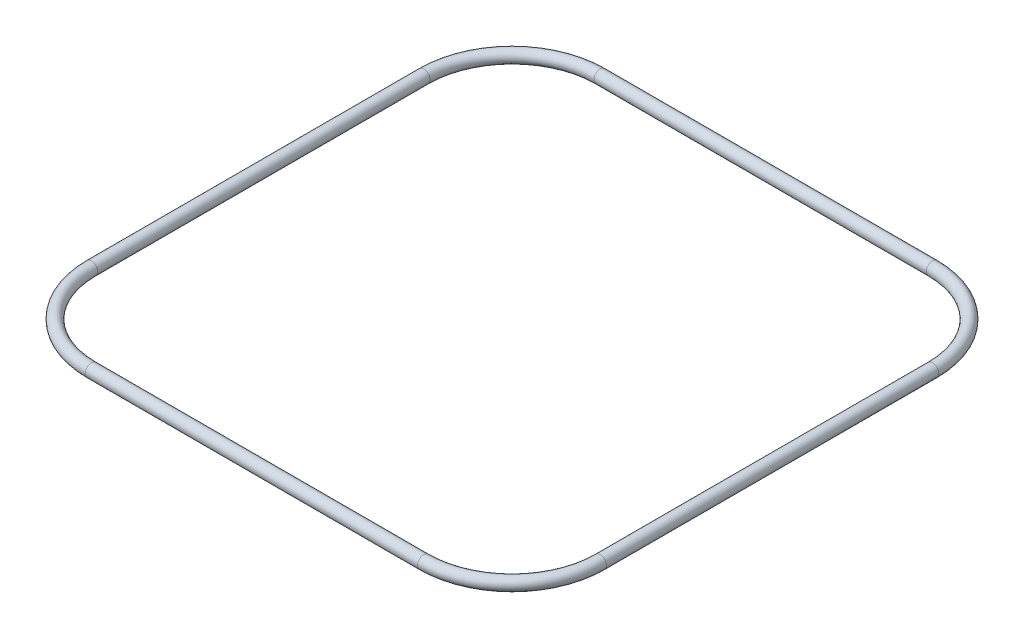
ISO-10303-21;
HEADER;
FILE_DESCRIPTION(('STEP AP214'),'2;1');
FILE_NAME('part.step','',(''),(''),'','','');
FILE_SCHEMA(('AUTOMOTIVE_DESIGN { 1 0 10303 214 1 1 1 1 }'));
ENDSEC;
DATA;
#1=APPLICATION_CONTEXT('core data for automotive mechanical design processes');
#2=APPLICATION_PROTOCOL_DEFINITION('international standard','automotive_design',2000,#1);
#3=PRODUCT_CONTEXT('',#1,'mechanical');
#4=PRODUCT('Part','Part','',(#3));
#5=PRODUCT_RELATED_PRODUCT_CATEGORY('part','',(#4));
#6=PRODUCT_DEFINITION_FORMATION('','',#4);
#7=PRODUCT_DEFINITION_CONTEXT('part definition',#1,'design');
#8=PRODUCT_DEFINITION('design','',#6,#7);
#9=PRODUCT_DEFINITION_SHAPE('','',#8);
#10=(LENGTH_UNIT() NAMED_UNIT(*) SI_UNIT(.MILLI.,.METRE.));
#11=(NAMED_UNIT(*) PLANE_ANGLE_UNIT() SI_UNIT($,.RADIAN.));
#12=(NAMED_UNIT(*) SI_UNIT($,.STERADIAN.) SOLID_ANGLE_UNIT());
#13=UNCERTAINTY_MEASURE_WITH_UNIT(LENGTH_MEASURE(1.E-05),#10,'distance_accuracy_value','');
#14=(GEOMETRIC_REPRESENTATION_CONTEXT(3) GLOBAL_UNCERTAINTY_ASSIGNED_CONTEXT((#13)) GLOBAL_UNIT_ASSIGNED_CONTEXT((#10,
#11,#12)) REPRESENTATION_CONTEXT('',''));
#15=CARTESIAN_POINT('',(0.,0.,0.));
#16=DIRECTION('',(0.,0.,1.));
#17=DIRECTION('',(1.,0.,0.));
#18=AXIS2_PLACEMENT_3D('',#15,#16,#17);
#19=CARTESIAN_POINT('',(23.4445,5.55111512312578E-13,-12.4444999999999));
#20=DIRECTION('',(0.,-1.,0.));
#21=DIRECTION('',(0.,0.,-1.));
#22=AXIS2_PLACEMENT_3D('',#19,#20,#21);
#23=TOROIDAL_SURFACE('',#22,12.4445,0.889);
#24=CARTESIAN_POINT('',(35.8890000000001,-2.22044604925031E-13,-12.4444999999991));
#25=DIRECTION('',(0.,0.,-1.));
#26=DIRECTION('',(-1.,0.,0.));
#27=AXIS2_PLACEMENT_3D('',#24,#25,#26);
#28=CIRCLE('',#27,0.889);
#29=CARTESIAN_POINT('',(36.778,-2.77562447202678E-13,-12.444499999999));
#30=VERTEX_POINT('',#29);
#31=EDGE_CURVE('E38',#30,#30,#28,.T.);
#32=CARTESIAN_POINT('',(23.4444999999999,4.44089209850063E-13,0.));
#33=DIRECTION('',(1.,0.,0.));
#34=DIRECTION('',(0.,0.,-1.));
#35=AXIS2_PLACEMENT_3D('',#32,#33,#34);
#36=CIRCLE('',#35,0.889);
#37=CARTESIAN_POINT('',(23.4444999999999,4.36158089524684E-13,0.889000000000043));
#38=VERTEX_POINT('',#37);
#39=EDGE_CURVE('E10',#38,#38,#36,.T.);
#40=CARTESIAN_POINT('',(23.4445,5.55111512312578E-13,-12.4444999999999));
#41=DIRECTION('',(0.,-1.,0.));
#42=DIRECTION('',(0.,0.,-1.));
#43=AXIS2_PLACEMENT_3D('',#40,#41,#42);
#44=CIRCLE('',#43,13.3335);
#45=EDGE_CURVE('',#30,#38,#44,.T.);
#46=ORIENTED_EDGE('',*,*,#31,.F.);
#47=ORIENTED_EDGE('',*,*,#39,.T.);
#48=ORIENTED_EDGE('',*,*,#45,.T.);
#49=ORIENTED_EDGE('',*,*,#45,.F.);
#50=EDGE_LOOP('',(#46,#48,#47,#49));
#51=FACE_BOUND('',#50,.T.);
#52=ADVANCED_FACE('F32',(#51),#23,.T.);
#53=CARTESIAN_POINT('',(35.8889999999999,1.11022302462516E-13,-59.3334999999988));
#54=DIRECTION('',(0.,0.,1.));
#55=DIRECTION('',(1.,0.,0.));
#56=AXIS2_PLACEMENT_3D('',#53,#54,#55);
#57=CYLINDRICAL_SURFACE('',#56,0.889);
#58=CARTESIAN_POINT('',(35.8889999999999,1.11022302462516E-13,-59.3334999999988));
#59=DIRECTION('',(0.,0.,-1.));
#60=DIRECTION('',(-1.,0.,0.));
#61=AXIS2_PLACEMENT_3D('',#58,#59,#60);
#62=CIRCLE('',#61,0.889);
#63=CARTESIAN_POINT('',(36.778,0.,-59.3334999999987));
#64=VERTEX_POINT('',#63);
#65=EDGE_CURVE('E42',#64,#64,#62,.T.);
#66=ORIENTED_EDGE('',*,*,#65,.F.);
#67=EDGE_LOOP('',(#66));
#68=FACE_BOUND('',#67,.T.);
#69=ORIENTED_EDGE('',*,*,#31,.T.);
#70=EDGE_LOOP('',(#69));
#71=FACE_BOUND('',#70,.T.);
#72=ADVANCED_FACE('F94',(#68,#71),#57,.T.);
#73=CARTESIAN_POINT('',(23.4445,6.66133814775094E-13,-59.3335000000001));
#74=DIRECTION('',(0.,-1.,0.));
#75=DIRECTION('',(0.,0.,-1.));
#76=AXIS2_PLACEMENT_3D('',#73,#74,#75);
#77=TOROIDAL_SURFACE('',#76,12.4445,0.889);
#78=CARTESIAN_POINT('',(23.4444999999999,-1.11022302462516E-13,-71.7779999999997));
#79=DIRECTION('',(-1.,0.,0.));
#80=DIRECTION('',(0.,0.,1.));
#81=AXIS2_PLACEMENT_3D('',#78,#79,#80);
#82=CIRCLE('',#81,0.889);
#83=CARTESIAN_POINT('',(23.4444999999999,-1.66540144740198E-13,-72.6670000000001));
#84=VERTEX_POINT('',#83);
#85=EDGE_CURVE('E46',#84,#84,#82,.T.);
#86=CARTESIAN_POINT('',(23.4445,6.66133814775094E-13,-59.3335000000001));
#87=DIRECTION('',(0.,-1.,0.));
#88=DIRECTION('',(0.,0.,-1.));
#89=AXIS2_PLACEMENT_3D('',#86,#87,#88);
#90=CIRCLE('',#89,13.3335);
#91=EDGE_CURVE('',#84,#64,#90,.T.);
#92=ORIENTED_EDGE('',*,*,#85,.F.);
#93=ORIENTED_EDGE('',*,*,#65,.T.);
#94=ORIENTED_EDGE('',*,*,#91,.T.);
#95=ORIENTED_EDGE('',*,*,#91,.F.);
#96=EDGE_LOOP('',(#92,#94,#93,#95));
#97=FACE_BOUND('',#96,.T.);
#98=ADVANCED_FACE('F88',(#97),#77,.T.);
#99=CARTESIAN_POINT('',(-23.4445000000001,2.22044604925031E-13,-71.7779999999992));
#100=DIRECTION('',(1.,0.,0.));
#101=DIRECTION('',(0.,0.,-1.));
#102=AXIS2_PLACEMENT_3D('',#99,#100,#101);
#103=CYLINDRICAL_SURFACE('',#102,0.889);
#104=CARTESIAN_POINT('',(-23.4445000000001,2.22044604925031E-13,-71.7779999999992));
#105=DIRECTION('',(-1.,0.,0.));
#106=DIRECTION('',(0.,0.,1.));
#107=AXIS2_PLACEMENT_3D('',#104,#105,#106);
#108=CIRCLE('',#107,0.889);
#109=CARTESIAN_POINT('',(-23.4445000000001,1.82389003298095E-13,-72.6670000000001));
#110=VERTEX_POINT('',#109);
#111=EDGE_CURVE('E51',#110,#110,#108,.T.);
#112=ORIENTED_EDGE('',*,*,#111,.F.);
#113=EDGE_LOOP('',(#112));
#114=FACE_BOUND('',#113,.T.);
#115=ORIENTED_EDGE('',*,*,#85,.T.);
#116=EDGE_LOOP('',(#115));
#117=FACE_BOUND('',#116,.T.);
#118=ADVANCED_FACE('F82',(#114,#117),#103,.T.);
#119=CARTESIAN_POINT('',(-23.4445,7.7715611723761E-13,-59.3335000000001));
#120=DIRECTION('',(0.,-1.,0.));
#121=DIRECTION('',(0.,0.,-1.));
#122=AXIS2_PLACEMENT_3D('',#119,#120,#121);
#123=TOROIDAL_SURFACE('',#122,12.4445,0.889);
#124=CARTESIAN_POINT('',(-35.889,6.66133814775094E-13,-59.3334999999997));
#125=DIRECTION('',(0.,0.,1.));
#126=DIRECTION('',(1.,0.,0.));
#127=AXIS2_PLACEMENT_3D('',#124,#125,#126);
#128=CIRCLE('',#127,0.889);
#129=CARTESIAN_POINT('',(-36.778,6.58202694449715E-13,-59.3334999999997));
#130=VERTEX_POINT('',#129);
#131=EDGE_CURVE('E54',#130,#130,#128,.T.);
#132=CARTESIAN_POINT('',(-23.4445,7.7715611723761E-13,-59.3335000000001));
#133=DIRECTION('',(0.,-1.,0.));
#134=DIRECTION('',(0.,0.,-1.));
#135=AXIS2_PLACEMENT_3D('',#132,#133,#134);
#136=CIRCLE('',#135,13.3335);
#137=EDGE_CURVE('',#130,#110,#136,.T.);
#138=ORIENTED_EDGE('',*,*,#131,.F.);
#139=ORIENTED_EDGE('',*,*,#111,.T.);
#140=ORIENTED_EDGE('',*,*,#137,.T.);
#141=ORIENTED_EDGE('',*,*,#137,.F.);
#142=EDGE_LOOP('',(#138,#140,#139,#141));
#143=FACE_BOUND('',#142,.T.);
#144=ADVANCED_FACE('F76',(#143),#123,.T.);
#145=CARTESIAN_POINT('',(-35.889,6.66133814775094E-13,-12.4444999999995));
#146=DIRECTION('',(0.,0.,-1.));
#147=DIRECTION('',(-1.,0.,0.));
#148=AXIS2_PLACEMENT_3D('',#145,#146,#147);
#149=CYLINDRICAL_SURFACE('',#148,0.889);
#150=CARTESIAN_POINT('',(-35.889,6.66133814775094E-13,-12.4444999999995));
#151=DIRECTION('',(0.,0.,1.));
#152=DIRECTION('',(1.,0.,0.));
#153=AXIS2_PLACEMENT_3D('',#150,#151,#152);
#154=CIRCLE('',#153,0.889);
#155=CARTESIAN_POINT('',(-36.7779999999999,6.97858296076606E-13,-12.4444999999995));
#156=VERTEX_POINT('',#155);
#157=EDGE_CURVE('E57',#156,#156,#154,.T.);
#158=ORIENTED_EDGE('',*,*,#157,.F.);
#159=EDGE_LOOP('',(#158));
#160=FACE_BOUND('',#159,.T.);
#161=ORIENTED_EDGE('',*,*,#131,.T.);
#162=EDGE_LOOP('',(#161));
#163=FACE_BOUND('',#162,.T.);
#164=ADVANCED_FACE('F70',(#160,#163),#149,.T.);
#165=CARTESIAN_POINT('',(-23.4445,2.22044604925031E-13,-12.4445));
#166=DIRECTION('',(0.,-1.,0.));
#167=DIRECTION('',(0.,0.,-1.));
#168=AXIS2_PLACEMENT_3D('',#165,#166,#167);
#169=TOROIDAL_SURFACE('',#168,12.4445,0.889);
#170=CARTESIAN_POINT('',(-23.4445000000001,7.7715611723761E-13,4.44089209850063E-13));
#171=DIRECTION('',(1.,0.,0.));
#172=DIRECTION('',(0.,0.,-1.));
#173=AXIS2_PLACEMENT_3D('',#170,#171,#172);
#174=CIRCLE('',#173,0.889);
#175=CARTESIAN_POINT('',(-23.4445000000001,8.16811718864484E-13,0.889000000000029));
#176=VERTEX_POINT('',#175);
#177=EDGE_CURVE('E60',#176,#176,#174,.T.);
#178=CARTESIAN_POINT('',(-23.4445,2.22044604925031E-13,-12.4445));
#179=DIRECTION('',(0.,-1.,0.));
#180=DIRECTION('',(0.,0.,-1.));
#181=AXIS2_PLACEMENT_3D('',#178,#179,#180);
#182=CIRCLE('',#181,13.3335);
#183=EDGE_CURVE('',#176,#156,#182,.T.);
#184=ORIENTED_EDGE('',*,*,#177,.F.);
#185=ORIENTED_EDGE('',*,*,#157,.T.);
#186=ORIENTED_EDGE('',*,*,#183,.T.);
#187=ORIENTED_EDGE('',*,*,#183,.F.);
#188=EDGE_LOOP('',(#184,#186,#185,#187));
#189=FACE_BOUND('',#188,.T.);
#190=ADVANCED_FACE('F67',(#189),#169,.T.);
#191=CARTESIAN_POINT('',(-23.4445000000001,7.7715611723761E-13,4.44089209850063E-13));
#192=DIRECTION('',(1.,0.,0.));
#193=DIRECTION('',(0.,0.,-1.));
#194=AXIS2_PLACEMENT_3D('',#191,#192,#193);
#195=CYLINDRICAL_SURFACE('',#194,0.889);
#196=ORIENTED_EDGE('',*,*,#177,.T.);
#197=EDGE_LOOP('',(#196));
#198=FACE_BOUND('',#197,.T.);
#199=ORIENTED_EDGE('',*,*,#39,.F.);
#200=EDGE_LOOP('',(#199));
#201=FACE_BOUND('',#200,.T.);
#202=ADVANCED_FACE('F64',(#198,#201),#195,.T.);
#203=CLOSED_SHELL('',(#52,#72,#98,#118,#144,#164,#190,#202));
#204=MANIFOLD_SOLID_BREP('B2',#203);
#205=ADVANCED_BREP_SHAPE_REPRESENTATION('',(#18,#204),#14);
#206=SHAPE_DEFINITION_REPRESENTATION(#9,#205);
ENDSEC;
END-ISO-10303-21;
